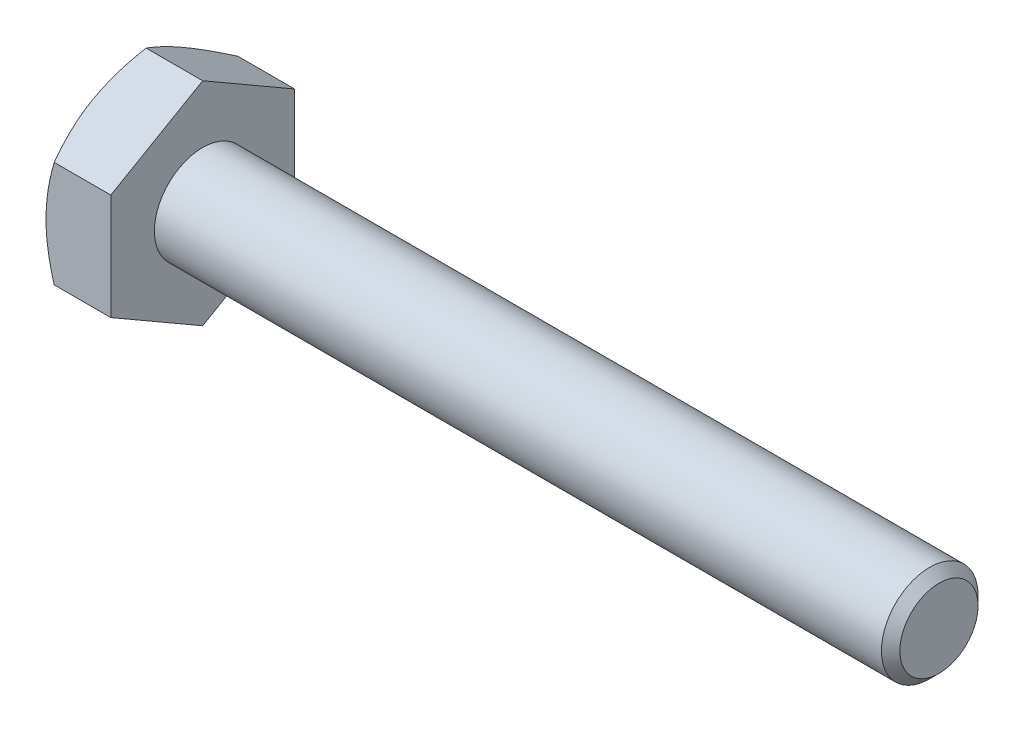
ISO-10303-21;
HEADER;
FILE_DESCRIPTION(('STEP AP214'),'2;1');
FILE_NAME('part.step','',(''),(''),'','','');
FILE_SCHEMA(('AUTOMOTIVE_DESIGN { 1 0 10303 214 1 1 1 1 }'));
ENDSEC;
DATA;
#1=APPLICATION_CONTEXT('core data for automotive mechanical design processes');
#2=APPLICATION_PROTOCOL_DEFINITION('international standard','automotive_design',2000,#1);
#3=PRODUCT_CONTEXT('',#1,'mechanical');
#4=PRODUCT('Part','Part','',(#3));
#5=PRODUCT_RELATED_PRODUCT_CATEGORY('part','',(#4));
#6=PRODUCT_DEFINITION_FORMATION('','',#4);
#7=PRODUCT_DEFINITION_CONTEXT('part definition',#1,'design');
#8=PRODUCT_DEFINITION('design','',#6,#7);
#9=PRODUCT_DEFINITION_SHAPE('','',#8);
#10=(LENGTH_UNIT() NAMED_UNIT(*) SI_UNIT(.MILLI.,.METRE.));
#11=(NAMED_UNIT(*) PLANE_ANGLE_UNIT() SI_UNIT($,.RADIAN.));
#12=(NAMED_UNIT(*) SI_UNIT($,.STERADIAN.) SOLID_ANGLE_UNIT());
#13=UNCERTAINTY_MEASURE_WITH_UNIT(LENGTH_MEASURE(1.E-05),#10,'distance_accuracy_value','');
#14=(GEOMETRIC_REPRESENTATION_CONTEXT(3) GLOBAL_UNCERTAINTY_ASSIGNED_CONTEXT((#13)) GLOBAL_UNIT_ASSIGNED_CONTEXT((#10,
#11,#12)) REPRESENTATION_CONTEXT('',''));
#15=CARTESIAN_POINT('',(0.,0.,0.));
#16=DIRECTION('',(0.,0.,1.));
#17=DIRECTION('',(1.,0.,0.));
#18=AXIS2_PLACEMENT_3D('',#15,#16,#17);
#19=CARTESIAN_POINT('',(-2.5136,0.,0.));
#20=DIRECTION('',(1.,0.,0.));
#21=DIRECTION('',(0.,0.,-1.));
#22=AXIS2_PLACEMENT_3D('',#19,#20,#21);
#23=PLANE('',#22);
#24=CARTESIAN_POINT('',(-2.5136,0.,0.));
#25=DIRECTION('',(1.,0.,0.));
#26=DIRECTION('',(0.,1.,0.));
#27=AXIS2_PLACEMENT_3D('',#24,#25,#26);
#28=CIRCLE('',#27,3.16992);
#29=CARTESIAN_POINT('',(-2.5136,3.16992,0.));
#30=VERTEX_POINT('',#29);
#31=EDGE_CURVE('E19',#30,#30,#28,.F.);
#32=ORIENTED_EDGE('',*,*,#31,.T.);
#33=EDGE_LOOP('',(#32));
#34=FACE_BOUND('',#33,.T.);
#35=ADVANCED_FACE('F16',(#34),#23,.F.);
#36=CARTESIAN_POINT('',(-2.794,0.,0.));
#37=DIRECTION('',(1.,0.,0.));
#38=DIRECTION('',(0.,1.,0.));
#39=AXIS2_PLACEMENT_3D('',#36,#37,#38);
#40=CYLINDRICAL_SURFACE('',#39,3.16992);
#41=CARTESIAN_POINT('',(-2.794,0.,0.));
#42=DIRECTION('',(1.,0.,0.));
#43=DIRECTION('',(0.,1.,0.));
#44=AXIS2_PLACEMENT_3D('',#41,#42,#43);
#45=CIRCLE('',#44,3.16992);
#46=CARTESIAN_POINT('',(-2.794,3.16992,0.));
#47=VERTEX_POINT('',#46);
#48=EDGE_CURVE('E114',#47,#47,#45,.F.);
#49=ORIENTED_EDGE('',*,*,#48,.T.);
#50=EDGE_LOOP('',(#49));
#51=FACE_BOUND('',#50,.T.);
#52=ORIENTED_EDGE('',*,*,#31,.F.);
#53=EDGE_LOOP('',(#52));
#54=FACE_BOUND('',#53,.T.);
#55=ADVANCED_FACE('F347',(#51,#54),#40,.F.);
#56=CARTESIAN_POINT('',(-2.794,0.,0.));
#57=DIRECTION('',(1.,0.,0.));
#58=DIRECTION('',(0.,0.,-1.));
#59=AXIS2_PLACEMENT_3D('',#56,#57,#58);
#60=PLANE('',#59);
#61=ORIENTED_EDGE('',*,*,#48,.F.);
#62=EDGE_LOOP('',(#61));
#63=FACE_BOUND('',#62,.T.);
#64=CARTESIAN_POINT('',(-2.79400000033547,0.,0.));
#65=DIRECTION('',(1.,0.,0.));
#66=DIRECTION('',(0.,0.,-1.));
#67=AXIS2_PLACEMENT_3D('',#64,#65,#66);
#68=CIRCLE('',#67,3.96240000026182);
#69=CARTESIAN_POINT('',(-2.79400000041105,3.43153906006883,-1.98120000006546));
#70=VERTEX_POINT('',#69);
#71=CARTESIAN_POINT('',(-2.79400000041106,3.43153906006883,1.98120000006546));
#72=VERTEX_POINT('',#71);
#73=EDGE_CURVE('E332',#70,#72,#68,.T.);
#74=ORIENTED_EDGE('',*,*,#73,.F.);
#75=CARTESIAN_POINT('',(-2.79400000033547,0.,0.));
#76=DIRECTION('',(1.,0.,0.));
#77=DIRECTION('',(0.,0.,-1.));
#78=AXIS2_PLACEMENT_3D('',#75,#76,#77);
#79=CIRCLE('',#78,3.96240000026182);
#80=CARTESIAN_POINT('',(-2.79400000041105,0.,-3.96240000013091));
#81=VERTEX_POINT('',#80);
#82=EDGE_CURVE('E333',#81,#70,#79,.T.);
#83=ORIENTED_EDGE('',*,*,#82,.F.);
#84=CARTESIAN_POINT('',(-2.79400000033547,0.,0.));
#85=DIRECTION('',(1.,0.,0.));
#86=DIRECTION('',(0.,0.,-1.));
#87=AXIS2_PLACEMENT_3D('',#84,#85,#86);
#88=CIRCLE('',#87,3.96240000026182);
#89=CARTESIAN_POINT('',(-2.79400000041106,-3.43153906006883,-1.98120000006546));
#90=VERTEX_POINT('',#89);
#91=EDGE_CURVE('E335',#90,#81,#88,.T.);
#92=ORIENTED_EDGE('',*,*,#91,.F.);
#93=CARTESIAN_POINT('',(-2.79400000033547,0.,0.));
#94=DIRECTION('',(1.,0.,0.));
#95=DIRECTION('',(0.,0.,-1.));
#96=AXIS2_PLACEMENT_3D('',#93,#94,#95);
#97=CIRCLE('',#96,3.96240000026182);
#98=CARTESIAN_POINT('',(-2.79400000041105,-3.43153906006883,1.98120000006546));
#99=VERTEX_POINT('',#98);
#100=EDGE_CURVE('E92',#99,#90,#97,.T.);
#101=ORIENTED_EDGE('',*,*,#100,.F.);
#102=CARTESIAN_POINT('',(-2.79400000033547,0.,0.));
#103=DIRECTION('',(1.,0.,0.));
#104=DIRECTION('',(0.,0.,-1.));
#105=AXIS2_PLACEMENT_3D('',#102,#103,#104);
#106=CIRCLE('',#105,3.96240000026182);
#107=CARTESIAN_POINT('',(-2.79400000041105,0.,3.96240000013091));
#108=VERTEX_POINT('',#107);
#109=EDGE_CURVE('E88',#108,#99,#106,.T.);
#110=ORIENTED_EDGE('',*,*,#109,.F.);
#111=CARTESIAN_POINT('',(-2.79400000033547,0.,0.));
#112=DIRECTION('',(1.,0.,0.));
#113=DIRECTION('',(0.,0.,-1.));
#114=AXIS2_PLACEMENT_3D('',#111,#112,#113);
#115=CIRCLE('',#114,3.96240000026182);
#116=EDGE_CURVE('E85',#72,#108,#115,.T.);
#117=ORIENTED_EDGE('',*,*,#116,.F.);
#118=EDGE_LOOP('',(#74,#83,#92,#101,#110,#117));
#119=FACE_BOUND('',#118,.T.);
#120=ADVANCED_FACE('F90',(#63,#119),#60,.F.);
#121=CARTESIAN_POINT('',(-2.43796926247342,0.,0.));
#122=DIRECTION('',(1.,0.,0.));
#123=DIRECTION('',(0.,0.,-1.));
#124=AXIS2_PLACEMENT_3D('',#121,#122,#123);
#125=CONICAL_SURFACE('',#124,4.57906332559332,1.0471975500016);
#126=ORIENTED_EDGE('',*,*,#116,.T.);
#127=CARTESIAN_POINT('',(-2.44009270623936,2.28769270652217,3.96240000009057));
#128=CARTESIAN_POINT('',(-2.49386247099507,2.10147549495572,3.96240000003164));
#129=CARTESIAN_POINT('',(-2.54312496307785,1.91376698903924,3.96240000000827));
#130=CARTESIAN_POINT('',(-2.62999848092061,1.53669534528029,3.96239999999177));
#131=CARTESIAN_POINT('',(-2.6676671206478,1.3473453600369,3.96239999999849));
#132=CARTESIAN_POINT('',(-2.71391781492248,1.06153337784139,3.96240000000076));
#133=CARTESIAN_POINT('',(-2.72763161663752,0.965901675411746,3.9624000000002));
#134=CARTESIAN_POINT('',(-2.75137049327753,0.774180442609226,3.9623999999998));
#135=CARTESIAN_POINT('',(-2.76139566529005,0.678090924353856,3.96239999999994));
#136=CARTESIAN_POINT('',(-2.77758114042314,0.485098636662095,3.96240000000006));
#137=CARTESIAN_POINT('',(-2.78372178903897,0.388194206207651,3.96240000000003));
#138=CARTESIAN_POINT('',(-2.79193971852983,0.194194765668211,3.96239999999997));
#139=CARTESIAN_POINT('',(-2.79401619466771,0.0970997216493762,3.96239999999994));
#140=CARTESIAN_POINT('',(-2.79400000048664,7.71287001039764E-12,3.9624));
#141=B_SPLINE_CURVE_WITH_KNOTS('',3,(#127,#128,#129,#130,#131,#132,#133,#134,#135,#136,#137,
#138,#139,#140),.UNSPECIFIED.,.F.,.F.,(4,2,2,2,2,2,4),(0.,0.581709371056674,1.1604795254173,
1.45024433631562,1.74000151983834,2.03121330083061,2.32248273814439),.UNSPECIFIED.);
#142=CARTESIAN_POINT('',(-2.44009270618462,2.28769270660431,3.96239999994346));
#143=VERTEX_POINT('',#142);
#144=EDGE_CURVE('E111',#143,#108,#141,.T.);
#145=ORIENTED_EDGE('',*,*,#144,.F.);
#146=CARTESIAN_POINT('',(-2.79400000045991,3.43153905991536,1.98119999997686));
#147=CARTESIAN_POINT('',(-2.79401619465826,3.38298919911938,2.06529082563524));
#148=CARTESIAN_POINT('',(-2.79193971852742,3.33444167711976,2.14937760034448));
#149=CARTESIAN_POINT('',(-2.78372178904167,3.23744195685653,2.31738604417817));
#150=CARTESIAN_POINT('',(-2.77758114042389,3.188989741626,2.40130774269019));
#151=CARTESIAN_POINT('',(-2.76139566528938,3.09249359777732,2.56844396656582));
#152=CARTESIAN_POINT('',(-2.75137049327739,3.04444883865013,2.65165993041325));
#153=CARTESIAN_POINT('',(-2.72763161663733,2.94858822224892,2.81769538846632));
#154=CARTESIAN_POINT('',(-2.71391781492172,2.90077237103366,2.90051487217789));
#155=CARTESIAN_POINT('',(-2.66766712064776,2.75786637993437,3.14803530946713));
#156=CARTESIAN_POINT('',(-2.62999848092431,2.66319138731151,3.31201720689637));
#157=CARTESIAN_POINT('',(-2.54312496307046,2.47465556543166,3.63857082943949));
#158=CARTESIAN_POINT('',(-2.4938624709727,2.38080131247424,3.80113116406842));
#159=CARTESIAN_POINT('',(-2.44009270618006,2.28769270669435,3.9623999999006));
#160=B_SPLINE_CURVE_WITH_KNOTS('',3,(#146,#147,#148,#149,#150,#151,#152,#153,#154,#155,#156,
#157,#158,#159),.UNSPECIFIED.,.F.,.F.,(4,2,2,2,2,2,4),(0.,0.29126943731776,0.582481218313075,
0.872238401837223,1.1620032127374,1.74077336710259,2.32248273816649),.UNSPECIFIED.);
#161=EDGE_CURVE('E105',#72,#143,#160,.T.);
#162=ORIENTED_EDGE('',*,*,#161,.F.);
#163=EDGE_LOOP('',(#126,#145,#162));
#164=FACE_BOUND('',#163,.T.);
#165=ADVANCED_FACE('F110',(#164),#125,.T.);
#166=CARTESIAN_POINT('',(-2.43796926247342,0.,0.));
#167=DIRECTION('',(1.,0.,0.));
#168=DIRECTION('',(0.,0.,-1.));
#169=AXIS2_PLACEMENT_3D('',#166,#167,#168);
#170=CONICAL_SURFACE('',#169,4.57906332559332,1.0471975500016);
#171=CARTESIAN_POINT('',(-2.79400000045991,0.,3.96239999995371));
#172=CARTESIAN_POINT('',(-2.79401619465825,-0.0970997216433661,3.96239999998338));
#173=CARTESIAN_POINT('',(-2.79193971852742,-0.194194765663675,3.96239999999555));
#174=CARTESIAN_POINT('',(-2.78372178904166,-0.388194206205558,3.96240000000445));
#175=CARTESIAN_POINT('',(-2.77758114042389,-0.485098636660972,3.96240000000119));
#176=CARTESIAN_POINT('',(-2.76139566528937,-0.678090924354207,3.96239999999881));
#177=CARTESIAN_POINT('',(-2.75137049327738,-0.774180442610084,3.96239999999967));
#178=CARTESIAN_POINT('',(-2.72763161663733,-0.965901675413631,3.96240000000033));
#179=CARTESIAN_POINT('',(-2.71391781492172,-1.0615333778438,3.96240000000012));
#180=CARTESIAN_POINT('',(-2.66766712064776,-1.34734536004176,3.96239999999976));
#181=CARTESIAN_POINT('',(-2.6299984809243,-1.53669534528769,3.96239999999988));
#182=CARTESIAN_POINT('',(-2.54312496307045,-1.91376698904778,3.96240000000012));
#183=CARTESIAN_POINT('',(-2.4938624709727,-2.10147549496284,3.96240000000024));
#184=CARTESIAN_POINT('',(-2.44009270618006,-2.2876927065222,3.9624));
#185=B_SPLINE_CURVE_WITH_KNOTS('',3,(#171,#172,#173,#174,#175,#176,#177,#178,#179,#180,#181,
#182,#183,#184),.UNSPECIFIED.,.F.,.F.,(4,2,2,2,2,2,4),(0.,0.291269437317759,0.582481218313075,
0.872238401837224,1.1620032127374,1.74077336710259,2.3224827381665),.UNSPECIFIED.);
#186=CARTESIAN_POINT('',(-2.44009270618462,-2.28769270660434,3.96239999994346));
#187=VERTEX_POINT('',#186);
#188=EDGE_CURVE('E98',#108,#187,#185,.T.);
#189=ORIENTED_EDGE('',*,*,#188,.F.);
#190=ORIENTED_EDGE('',*,*,#109,.T.);
#191=CARTESIAN_POINT('',(-2.44009270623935,-2.28769270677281,3.96239999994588));
#192=CARTESIAN_POINT('',(-2.49386247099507,-2.380801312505,3.80113116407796));
#193=CARTESIAN_POINT('',(-2.54312496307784,-2.474655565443,3.63857082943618));
#194=CARTESIAN_POINT('',(-2.6299984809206,-2.66319138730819,3.31201720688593));
#195=CARTESIAN_POINT('',(-2.6676671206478,-2.75786637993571,3.14803530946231));
#196=CARTESIAN_POINT('',(-2.71391781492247,-2.90077237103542,2.90051487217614));
#197=CARTESIAN_POINT('',(-2.72763161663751,-2.94858822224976,2.81769538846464));
#198=CARTESIAN_POINT('',(-2.75137049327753,-3.04444883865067,2.65165993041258));
#199=CARTESIAN_POINT('',(-2.76139566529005,-3.09249359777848,2.56844396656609));
#200=CARTESIAN_POINT('',(-2.77758114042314,-3.18898974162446,2.40130774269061));
#201=CARTESIAN_POINT('',(-2.78372178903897,-3.23744195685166,2.31738604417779));
#202=CARTESIAN_POINT('',(-2.79193971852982,-3.33444167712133,2.14937760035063));
#203=CARTESIAN_POINT('',(-2.79401619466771,-3.38298919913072,2.06529082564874));
#204=CARTESIAN_POINT('',(-2.79400000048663,-3.4315390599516,1.98120000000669));
#205=B_SPLINE_CURVE_WITH_KNOTS('',3,(#191,#192,#193,#194,#195,#196,#197,#198,#199,#200,#201,
#202,#203,#204),.UNSPECIFIED.,.F.,.F.,(4,2,2,2,2,2,4),(0.,0.581709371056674,1.1604795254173,
1.45024433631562,1.74000151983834,2.03121330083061,2.32248273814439),.UNSPECIFIED.);
#206=EDGE_CURVE('E100',#187,#99,#205,.T.);
#207=ORIENTED_EDGE('',*,*,#206,.F.);
#208=EDGE_LOOP('',(#189,#190,#207));
#209=FACE_BOUND('',#208,.T.);
#210=ADVANCED_FACE('F99',(#209),#170,.T.);
#211=CARTESIAN_POINT('',(-2.43796926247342,0.,0.));
#212=DIRECTION('',(1.,0.,0.));
#213=DIRECTION('',(0.,0.,-1.));
#214=AXIS2_PLACEMENT_3D('',#211,#212,#213);
#215=CONICAL_SURFACE('',#214,4.57906332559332,1.0471975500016);
#216=CARTESIAN_POINT('',(-2.7940000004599,-3.43153905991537,1.98119999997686));
#217=CARTESIAN_POINT('',(-2.79401619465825,-3.48008892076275,1.89710917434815));
#218=CARTESIAN_POINT('',(-2.79193971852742,-3.52863644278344,1.81302239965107));
#219=CARTESIAN_POINT('',(-2.78372178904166,-3.6256361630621,1.64501395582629));
#220=CARTESIAN_POINT('',(-2.77758114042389,-3.67408837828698,1.56109225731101));
#221=CARTESIAN_POINT('',(-2.76139566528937,-3.77058452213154,1.393956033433));
#222=CARTESIAN_POINT('',(-2.75137049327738,-3.81862928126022,1.31074006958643));
#223=CARTESIAN_POINT('',(-2.72763161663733,-3.91448989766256,1.14470461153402));
#224=CARTESIAN_POINT('',(-2.71391781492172,-3.96230574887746,1.06188512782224));
#225=CARTESIAN_POINT('',(-2.66766712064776,-4.10521173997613,0.81436469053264));
#226=CARTESIAN_POINT('',(-2.6299984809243,-4.1998867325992,0.650382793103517));
#227=CARTESIAN_POINT('',(-2.54312496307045,-4.38842255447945,0.323829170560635));
#228=CARTESIAN_POINT('',(-2.4938624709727,-4.48227680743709,0.161268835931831));
#229=CARTESIAN_POINT('',(-2.44009270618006,-4.57538541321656,9.94113552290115E-11));
#230=B_SPLINE_CURVE_WITH_KNOTS('',3,(#216,#217,#218,#219,#220,#221,#222,#223,#224,#225,#226,
#227,#228,#229),.UNSPECIFIED.,.F.,.F.,(4,2,2,2,2,2,4),(0.,0.291269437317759,0.582481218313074,
0.872238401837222,1.1620032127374,1.74077336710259,2.32248273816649),.UNSPECIFIED.);
#231=CARTESIAN_POINT('',(-2.44009270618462,-4.57538541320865,0.));
#232=VERTEX_POINT('',#231);
#233=EDGE_CURVE('E118',#99,#232,#230,.T.);
#234=ORIENTED_EDGE('',*,*,#233,.F.);
#235=ORIENTED_EDGE('',*,*,#100,.T.);
#236=CARTESIAN_POINT('',(-2.44009270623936,-4.57538541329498,-1.44688809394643E-10));
#237=CARTESIAN_POINT('',(-2.49386247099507,-4.48227680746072,-0.161268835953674));
#238=CARTESIAN_POINT('',(-2.54312496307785,-4.38842255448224,-0.323829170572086));
#239=CARTESIAN_POINT('',(-2.62999848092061,-4.19988673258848,-0.650382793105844));
#240=CARTESIAN_POINT('',(-2.6676671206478,-4.1052117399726,-0.814364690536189));
#241=CARTESIAN_POINT('',(-2.71391781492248,-3.96230574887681,-1.06188512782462));
#242=CARTESIAN_POINT('',(-2.72763161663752,-3.91448989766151,-1.14470461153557));
#243=CARTESIAN_POINT('',(-2.75137049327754,-3.81862928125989,-1.31074006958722));
#244=CARTESIAN_POINT('',(-2.76139566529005,-3.77058452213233,-1.39395603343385));
#245=CARTESIAN_POINT('',(-2.77758114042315,-3.67408837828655,-1.56109225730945));
#246=CARTESIAN_POINT('',(-2.78372178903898,-3.62563616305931,-1.64501395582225));
#247=CARTESIAN_POINT('',(-2.79193971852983,-3.52863644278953,-1.81302239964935));
#248=CARTESIAN_POINT('',(-2.79401619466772,-3.48008892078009,-1.89710917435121));
#249=CARTESIAN_POINT('',(-2.79400000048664,-3.43153905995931,-1.98119999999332));
#250=B_SPLINE_CURVE_WITH_KNOTS('',3,(#236,#237,#238,#239,#240,#241,#242,#243,#244,#245,#246,
#247,#248,#249),.UNSPECIFIED.,.F.,.F.,(4,2,2,2,2,2,4),(0.,0.581709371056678,1.16047952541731,
1.45024433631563,1.74000151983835,2.03121330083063,2.32248273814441),.UNSPECIFIED.);
#251=EDGE_CURVE('E214',#232,#90,#250,.T.);
#252=ORIENTED_EDGE('',*,*,#251,.F.);
#253=EDGE_LOOP('',(#234,#235,#252));
#254=FACE_BOUND('',#253,.T.);
#255=ADVANCED_FACE('F222',(#254),#215,.T.);
#256=CARTESIAN_POINT('',(-2.43796926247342,0.,0.));
#257=DIRECTION('',(1.,0.,0.));
#258=DIRECTION('',(0.,0.,-1.));
#259=AXIS2_PLACEMENT_3D('',#256,#257,#258);
#260=CONICAL_SURFACE('',#259,4.57906332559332,1.0471975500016);
#261=CARTESIAN_POINT('',(-2.79400000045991,-3.43153905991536,-1.98119999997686));
#262=CARTESIAN_POINT('',(-2.79401619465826,-3.38298919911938,-2.06529082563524));
#263=CARTESIAN_POINT('',(-2.79193971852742,-3.33444167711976,-2.14937760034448));
#264=CARTESIAN_POINT('',(-2.78372178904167,-3.23744195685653,-2.31738604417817));
#265=CARTESIAN_POINT('',(-2.77758114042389,-3.188989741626,-2.40130774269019));
#266=CARTESIAN_POINT('',(-2.76139566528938,-3.09249359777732,-2.56844396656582));
#267=CARTESIAN_POINT('',(-2.75137049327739,-3.04444883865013,-2.65165993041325));
#268=CARTESIAN_POINT('',(-2.72763161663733,-2.94858822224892,-2.81769538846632));
#269=CARTESIAN_POINT('',(-2.71391781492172,-2.90077237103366,-2.90051487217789));
#270=CARTESIAN_POINT('',(-2.66766712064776,-2.75786637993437,-3.14803530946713));
#271=CARTESIAN_POINT('',(-2.62999848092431,-2.66319138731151,-3.31201720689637));
#272=CARTESIAN_POINT('',(-2.54312496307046,-2.47465556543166,-3.63857082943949));
#273=CARTESIAN_POINT('',(-2.4938624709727,-2.38080131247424,-3.80113116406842));
#274=CARTESIAN_POINT('',(-2.44009270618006,-2.28769270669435,-3.9623999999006));
#275=B_SPLINE_CURVE_WITH_KNOTS('',3,(#261,#262,#263,#264,#265,#266,#267,#268,#269,#270,#271,
#272,#273,#274),.UNSPECIFIED.,.F.,.F.,(4,2,2,2,2,2,4),(0.,0.291269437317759,0.582481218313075,
0.872238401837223,1.1620032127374,1.74077336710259,2.32248273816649),.UNSPECIFIED.);
#276=CARTESIAN_POINT('',(-2.44009270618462,-2.28769270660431,-3.96239999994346));
#277=VERTEX_POINT('',#276);
#278=EDGE_CURVE('E226',#90,#277,#275,.T.);
#279=ORIENTED_EDGE('',*,*,#278,.F.);
#280=ORIENTED_EDGE('',*,*,#91,.T.);
#281=CARTESIAN_POINT('',(-2.44009270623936,-2.28769270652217,-3.96240000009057));
#282=CARTESIAN_POINT('',(-2.49386247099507,-2.10147549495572,-3.96240000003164));
#283=CARTESIAN_POINT('',(-2.54312496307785,-1.91376698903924,-3.96240000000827));
#284=CARTESIAN_POINT('',(-2.62999848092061,-1.53669534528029,-3.96239999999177));
#285=CARTESIAN_POINT('',(-2.6676671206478,-1.3473453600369,-3.96239999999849));
#286=CARTESIAN_POINT('',(-2.71391781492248,-1.06153337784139,-3.96240000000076));
#287=CARTESIAN_POINT('',(-2.72763161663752,-0.965901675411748,-3.9624000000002));
#288=CARTESIAN_POINT('',(-2.75137049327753,-0.774180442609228,-3.9623999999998));
#289=CARTESIAN_POINT('',(-2.76139566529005,-0.678090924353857,-3.96239999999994));
#290=CARTESIAN_POINT('',(-2.77758114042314,-0.485098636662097,-3.96240000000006));
#291=CARTESIAN_POINT('',(-2.78372178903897,-0.388194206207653,-3.96240000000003));
#292=CARTESIAN_POINT('',(-2.79193971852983,-0.194194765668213,-3.96239999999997));
#293=CARTESIAN_POINT('',(-2.79401619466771,-0.0970997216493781,-3.96239999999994));
#294=CARTESIAN_POINT('',(-2.79400000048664,-7.71468599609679E-12,-3.9624));
#295=B_SPLINE_CURVE_WITH_KNOTS('',3,(#281,#282,#283,#284,#285,#286,#287,#288,#289,#290,#291,
#292,#293,#294),.UNSPECIFIED.,.F.,.F.,(4,2,2,2,2,2,4),(0.,0.581709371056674,1.1604795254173,
1.45024433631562,1.74000151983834,2.03121330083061,2.32248273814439),.UNSPECIFIED.);
#296=EDGE_CURVE('E208',#277,#81,#295,.T.);
#297=ORIENTED_EDGE('',*,*,#296,.F.);
#298=EDGE_LOOP('',(#279,#280,#297));
#299=FACE_BOUND('',#298,.T.);
#300=ADVANCED_FACE('F219',(#299),#260,.T.);
#301=CARTESIAN_POINT('',(-2.43796926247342,0.,0.));
#302=DIRECTION('',(1.,0.,0.));
#303=DIRECTION('',(0.,0.,-1.));
#304=AXIS2_PLACEMENT_3D('',#301,#302,#303);
#305=CONICAL_SURFACE('',#304,4.57906332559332,1.0471975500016);
#306=ORIENTED_EDGE('',*,*,#82,.T.);
#307=CARTESIAN_POINT('',(-2.44009270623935,2.28769270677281,-3.96239999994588));
#308=CARTESIAN_POINT('',(-2.49386247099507,2.380801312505,-3.80113116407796));
#309=CARTESIAN_POINT('',(-2.54312496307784,2.474655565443,-3.63857082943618));
#310=CARTESIAN_POINT('',(-2.6299984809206,2.66319138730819,-3.31201720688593));
#311=CARTESIAN_POINT('',(-2.6676671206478,2.75786637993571,-3.14803530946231));
#312=CARTESIAN_POINT('',(-2.71391781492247,2.90077237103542,-2.90051487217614));
#313=CARTESIAN_POINT('',(-2.72763161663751,2.94858822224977,-2.81769538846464));
#314=CARTESIAN_POINT('',(-2.75137049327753,3.04444883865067,-2.65165993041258));
#315=CARTESIAN_POINT('',(-2.76139566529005,3.09249359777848,-2.56844396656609));
#316=CARTESIAN_POINT('',(-2.77758114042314,3.18898974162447,-2.40130774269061));
#317=CARTESIAN_POINT('',(-2.78372178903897,3.23744195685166,-2.31738604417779));
#318=CARTESIAN_POINT('',(-2.79193971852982,3.33444167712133,-2.14937760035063));
#319=CARTESIAN_POINT('',(-2.79401619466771,3.38298919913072,-2.06529082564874));
#320=CARTESIAN_POINT('',(-2.79400000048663,3.43153905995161,-1.98120000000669));
#321=B_SPLINE_CURVE_WITH_KNOTS('',3,(#307,#308,#309,#310,#311,#312,#313,#314,#315,#316,#317,
#318,#319,#320),.UNSPECIFIED.,.F.,.F.,(4,2,2,2,2,2,4),(0.,0.581709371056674,1.1604795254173,
1.45024433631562,1.74000151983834,2.03121330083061,2.32248273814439),.UNSPECIFIED.);
#322=CARTESIAN_POINT('',(-2.44009270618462,2.28769270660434,-3.96239999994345));
#323=VERTEX_POINT('',#322);
#324=EDGE_CURVE('E180',#323,#70,#321,.T.);
#325=ORIENTED_EDGE('',*,*,#324,.F.);
#326=CARTESIAN_POINT('',(-2.79400000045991,0.,-3.96239999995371));
#327=CARTESIAN_POINT('',(-2.79401619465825,0.0970997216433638,-3.96239999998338));
#328=CARTESIAN_POINT('',(-2.79193971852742,0.194194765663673,-3.96239999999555));
#329=CARTESIAN_POINT('',(-2.78372178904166,0.388194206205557,-3.96240000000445));
#330=CARTESIAN_POINT('',(-2.77758114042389,0.48509863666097,-3.96240000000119));
#331=CARTESIAN_POINT('',(-2.76139566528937,0.678090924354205,-3.96239999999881));
#332=CARTESIAN_POINT('',(-2.75137049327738,0.774180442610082,-3.96239999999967));
#333=CARTESIAN_POINT('',(-2.72763161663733,0.96590167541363,-3.96240000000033));
#334=CARTESIAN_POINT('',(-2.71391781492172,1.0615333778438,-3.96240000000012));
#335=CARTESIAN_POINT('',(-2.66766712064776,1.34734536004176,-3.96239999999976));
#336=CARTESIAN_POINT('',(-2.6299984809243,1.53669534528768,-3.96239999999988));
#337=CARTESIAN_POINT('',(-2.54312496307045,1.91376698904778,-3.96240000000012));
#338=CARTESIAN_POINT('',(-2.4938624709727,2.10147549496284,-3.96240000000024));
#339=CARTESIAN_POINT('',(-2.44009270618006,2.2876927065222,-3.9624));
#340=B_SPLINE_CURVE_WITH_KNOTS('',3,(#326,#327,#328,#329,#330,#331,#332,#333,#334,#335,#336,
#337,#338,#339),.UNSPECIFIED.,.F.,.F.,(4,2,2,2,2,2,4),(0.,0.29126943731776,0.582481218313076,
0.872238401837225,1.16200321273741,1.74077336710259,2.3224827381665),.UNSPECIFIED.);
#341=EDGE_CURVE('E203',#81,#323,#340,.T.);
#342=ORIENTED_EDGE('',*,*,#341,.F.);
#343=EDGE_LOOP('',(#306,#325,#342));
#344=FACE_BOUND('',#343,.T.);
#345=ADVANCED_FACE('F165',(#344),#305,.T.);
#346=CARTESIAN_POINT('',(-2.43796926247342,0.,0.));
#347=DIRECTION('',(1.,0.,0.));
#348=DIRECTION('',(0.,0.,-1.));
#349=AXIS2_PLACEMENT_3D('',#346,#347,#348);
#350=CONICAL_SURFACE('',#349,4.57906332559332,1.0471975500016);
#351=ORIENTED_EDGE('',*,*,#73,.T.);
#352=CARTESIAN_POINT('',(-2.44009270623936,4.57538541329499,1.44686354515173E-10));
#353=CARTESIAN_POINT('',(-2.49386247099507,4.48227680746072,0.161268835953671));
#354=CARTESIAN_POINT('',(-2.54312496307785,4.38842255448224,0.323829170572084));
#355=CARTESIAN_POINT('',(-2.62999848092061,4.19988673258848,0.650382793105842));
#356=CARTESIAN_POINT('',(-2.6676671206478,4.10521173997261,0.814364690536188));
#357=CARTESIAN_POINT('',(-2.71391781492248,3.96230574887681,1.06188512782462));
#358=CARTESIAN_POINT('',(-2.72763161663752,3.91448989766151,1.14470461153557));
#359=CARTESIAN_POINT('',(-2.75137049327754,3.81862928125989,1.31074006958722));
#360=CARTESIAN_POINT('',(-2.76139566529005,3.77058452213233,1.39395603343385));
#361=CARTESIAN_POINT('',(-2.77758114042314,3.67408837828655,1.56109225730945));
#362=CARTESIAN_POINT('',(-2.78372178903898,3.62563616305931,1.64501395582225));
#363=CARTESIAN_POINT('',(-2.79193971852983,3.52863644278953,1.81302239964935));
#364=CARTESIAN_POINT('',(-2.79401619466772,3.48008892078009,1.89710917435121));
#365=CARTESIAN_POINT('',(-2.79400000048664,3.43153905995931,1.98119999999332));
#366=B_SPLINE_CURVE_WITH_KNOTS('',3,(#352,#353,#354,#355,#356,#357,#358,#359,#360,#361,#362,
#363,#364,#365),.UNSPECIFIED.,.F.,.F.,(4,2,2,2,2,2,4),(0.,0.581709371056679,1.16047952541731,
1.45024433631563,1.74000151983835,2.03121330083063,2.32248273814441),.UNSPECIFIED.);
#367=CARTESIAN_POINT('',(-2.44009270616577,4.5753854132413,5.65399492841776E-11));
#368=VERTEX_POINT('',#367);
#369=EDGE_CURVE('E150',#368,#72,#366,.T.);
#370=ORIENTED_EDGE('',*,*,#369,.F.);
#371=CARTESIAN_POINT('',(-2.7940000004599,3.43153905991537,-1.98119999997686));
#372=CARTESIAN_POINT('',(-2.79401619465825,3.48008892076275,-1.89710917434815));
#373=CARTESIAN_POINT('',(-2.79193971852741,3.52863644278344,-1.81302239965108));
#374=CARTESIAN_POINT('',(-2.78372178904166,3.6256361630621,-1.64501395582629));
#375=CARTESIAN_POINT('',(-2.77758114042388,3.67408837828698,-1.56109225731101));
#376=CARTESIAN_POINT('',(-2.76139566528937,3.77058452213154,-1.393956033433));
#377=CARTESIAN_POINT('',(-2.75137049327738,3.81862928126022,-1.31074006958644));
#378=CARTESIAN_POINT('',(-2.72763161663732,3.91448989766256,-1.14470461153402));
#379=CARTESIAN_POINT('',(-2.71391781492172,3.96230574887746,-1.06188512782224));
#380=CARTESIAN_POINT('',(-2.66766712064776,4.10521173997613,-0.814364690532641));
#381=CARTESIAN_POINT('',(-2.6299984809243,4.1998867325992,-0.650382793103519));
#382=CARTESIAN_POINT('',(-2.54312496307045,4.38842255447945,-0.323829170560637));
#383=CARTESIAN_POINT('',(-2.4938624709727,4.48227680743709,-0.161268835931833));
#384=CARTESIAN_POINT('',(-2.44009270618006,4.57538541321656,-9.9413722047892E-11));
#385=B_SPLINE_CURVE_WITH_KNOTS('',3,(#371,#372,#373,#374,#375,#376,#377,#378,#379,#380,#381,
#382,#383,#384),.UNSPECIFIED.,.F.,.F.,(4,2,2,2,2,2,4),(0.,0.291269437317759,0.582481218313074,
0.872238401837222,1.1620032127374,1.74077336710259,2.32248273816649),.UNSPECIFIED.);
#386=EDGE_CURVE('E171',#70,#368,#385,.T.);
#387=ORIENTED_EDGE('',*,*,#386,.F.);
#388=EDGE_LOOP('',(#351,#370,#387));
#389=FACE_BOUND('',#388,.T.);
#390=ADVANCED_FACE('F159',(#389),#350,.T.);
#391=CARTESIAN_POINT('',(0.,4.57538541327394,0.));
#392=DIRECTION('',(0.,0.866025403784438,0.500000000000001));
#393=DIRECTION('',(0.,-0.500000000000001,0.866025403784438));
#394=AXIS2_PLACEMENT_3D('',#391,#392,#393);
#395=PLANE('',#394);
#396=DIRECTION('',(0.,-0.500000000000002,0.866025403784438));
#397=VECTOR('',#396,1.);
#398=CARTESIAN_POINT('',(0.,4.57538541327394,0.));
#399=LINE('',#398,#397);
#400=CARTESIAN_POINT('',(0.,4.57538541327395,0.));
#401=VERTEX_POINT('',#400);
#402=CARTESIAN_POINT('',(0.,2.28769270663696,3.9624));
#403=VERTEX_POINT('',#402);
#404=EDGE_CURVE('E286',#401,#403,#399,.T.);
#405=ORIENTED_EDGE('',*,*,#404,.F.);
#406=DIRECTION('',(1.,0.,0.));
#407=VECTOR('',#406,1.);
#408=CARTESIAN_POINT('',(0.,4.57538541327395,0.));
#409=LINE('',#408,#407);
#410=EDGE_CURVE('E179',#368,#401,#409,.T.);
#411=ORIENTED_EDGE('',*,*,#410,.F.);
#412=ORIENTED_EDGE('',*,*,#369,.T.);
#413=ORIENTED_EDGE('',*,*,#161,.T.);
#414=DIRECTION('',(1.,0.,0.));
#415=VECTOR('',#414,1.);
#416=CARTESIAN_POINT('',(0.,2.28769270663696,3.9624));
#417=LINE('',#416,#415);
#418=EDGE_CURVE('E104',#403,#143,#417,.F.);
#419=ORIENTED_EDGE('',*,*,#418,.F.);
#420=EDGE_LOOP('',(#405,#411,#412,#413,#419));
#421=FACE_BOUND('',#420,.T.);
#422=ADVANCED_FACE('F156',(#421),#395,.T.);
#423=CARTESIAN_POINT('',(0.,2.28769270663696,3.9624));
#424=DIRECTION('',(0.,0.,1.));
#425=DIRECTION('',(1.,0.,0.));
#426=AXIS2_PLACEMENT_3D('',#423,#424,#425);
#427=PLANE('',#426);
#428=ORIENTED_EDGE('',*,*,#418,.T.);
#429=ORIENTED_EDGE('',*,*,#144,.T.);
#430=ORIENTED_EDGE('',*,*,#188,.T.);
#431=DIRECTION('',(1.,0.,0.));
#432=VECTOR('',#431,1.);
#433=CARTESIAN_POINT('',(0.,-2.28769270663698,3.9624));
#434=LINE('',#433,#432);
#435=CARTESIAN_POINT('',(0.,-2.28769270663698,3.9624));
#436=VERTEX_POINT('',#435);
#437=EDGE_CURVE('E120',#436,#187,#434,.F.);
#438=ORIENTED_EDGE('',*,*,#437,.F.);
#439=DIRECTION('',(0.,1.,0.));
#440=VECTOR('',#439,1.);
#441=CARTESIAN_POINT('',(0.,0.,3.9624));
#442=LINE('',#441,#440);
#443=EDGE_CURVE('E288',#403,#436,#442,.F.);
#444=ORIENTED_EDGE('',*,*,#443,.F.);
#445=EDGE_LOOP('',(#428,#429,#430,#438,#444));
#446=FACE_BOUND('',#445,.T.);
#447=ADVANCED_FACE('F116',(#446),#427,.T.);
#448=CARTESIAN_POINT('',(0.,-2.28769270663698,3.9624));
#449=DIRECTION('',(0.,-0.866025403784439,0.499999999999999));
#450=DIRECTION('',(0.,-0.499999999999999,-0.866025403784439));
#451=AXIS2_PLACEMENT_3D('',#448,#449,#450);
#452=PLANE('',#451);
#453=ORIENTED_EDGE('',*,*,#437,.T.);
#454=ORIENTED_EDGE('',*,*,#206,.T.);
#455=ORIENTED_EDGE('',*,*,#233,.T.);
#456=DIRECTION('',(1.,0.,0.));
#457=VECTOR('',#456,1.);
#458=CARTESIAN_POINT('',(0.,-4.57538541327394,0.));
#459=LINE('',#458,#457);
#460=CARTESIAN_POINT('',(0.,-4.57538541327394,0.));
#461=VERTEX_POINT('',#460);
#462=EDGE_CURVE('E231',#461,#232,#459,.F.);
#463=ORIENTED_EDGE('',*,*,#462,.F.);
#464=DIRECTION('',(0.,-0.499999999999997,-0.86602540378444));
#465=VECTOR('',#464,1.);
#466=CARTESIAN_POINT('',(0.,-2.28769270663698,3.9624));
#467=LINE('',#466,#465);
#468=EDGE_CURVE('E279',#436,#461,#467,.T.);
#469=ORIENTED_EDGE('',*,*,#468,.F.);
#470=EDGE_LOOP('',(#453,#454,#455,#463,#469));
#471=FACE_BOUND('',#470,.T.);
#472=ADVANCED_FACE('F235',(#471),#452,.T.);
#473=CARTESIAN_POINT('',(0.,-4.57538541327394,0.));
#474=DIRECTION('',(0.,-0.866025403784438,-0.500000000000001));
#475=DIRECTION('',(0.,0.500000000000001,-0.866025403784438));
#476=AXIS2_PLACEMENT_3D('',#473,#474,#475);
#477=PLANE('',#476);
#478=ORIENTED_EDGE('',*,*,#462,.T.);
#479=ORIENTED_EDGE('',*,*,#251,.T.);
#480=ORIENTED_EDGE('',*,*,#278,.T.);
#481=DIRECTION('',(-1.,0.,0.));
#482=VECTOR('',#481,1.);
#483=CARTESIAN_POINT('',(0.,-2.28769270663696,-3.9624));
#484=LINE('',#483,#482);
#485=CARTESIAN_POINT('',(0.,-2.28769270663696,-3.9624));
#486=VERTEX_POINT('',#485);
#487=EDGE_CURVE('E309',#486,#277,#484,.T.);
#488=ORIENTED_EDGE('',*,*,#487,.F.);
#489=DIRECTION('',(0.,0.500000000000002,-0.866025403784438));
#490=VECTOR('',#489,1.);
#491=CARTESIAN_POINT('',(0.,-4.57538541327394,0.));
#492=LINE('',#491,#490);
#493=EDGE_CURVE('E275',#461,#486,#492,.T.);
#494=ORIENTED_EDGE('',*,*,#493,.F.);
#495=EDGE_LOOP('',(#478,#479,#480,#488,#494));
#496=FACE_BOUND('',#495,.T.);
#497=ADVANCED_FACE('F200',(#496),#477,.T.);
#498=CARTESIAN_POINT('',(0.,-2.28769270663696,-3.9624));
#499=DIRECTION('',(0.,0.,-1.));
#500=DIRECTION('',(-1.,0.,0.));
#501=AXIS2_PLACEMENT_3D('',#498,#499,#500);
#502=PLANE('',#501);
#503=DIRECTION('',(0.,1.,0.));
#504=VECTOR('',#503,1.);
#505=CARTESIAN_POINT('',(0.,0.,-3.9624));
#506=LINE('',#505,#504);
#507=CARTESIAN_POINT('',(0.,2.28769270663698,-3.9624));
#508=VERTEX_POINT('',#507);
#509=EDGE_CURVE('E270',#486,#508,#506,.T.);
#510=ORIENTED_EDGE('',*,*,#509,.F.);
#511=ORIENTED_EDGE('',*,*,#487,.T.);
#512=ORIENTED_EDGE('',*,*,#296,.T.);
#513=ORIENTED_EDGE('',*,*,#341,.T.);
#514=DIRECTION('',(1.,0.,0.));
#515=VECTOR('',#514,1.);
#516=CARTESIAN_POINT('',(0.,2.28769270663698,-3.9624));
#517=LINE('',#516,#515);
#518=EDGE_CURVE('E34',#508,#323,#517,.F.);
#519=ORIENTED_EDGE('',*,*,#518,.F.);
#520=EDGE_LOOP('',(#510,#511,#512,#513,#519));
#521=FACE_BOUND('',#520,.T.);
#522=ADVANCED_FACE('F193',(#521),#502,.T.);
#523=CARTESIAN_POINT('',(0.,2.28769270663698,-3.9624));
#524=DIRECTION('',(0.,0.866025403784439,-0.5));
#525=DIRECTION('',(0.,0.5,0.866025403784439));
#526=AXIS2_PLACEMENT_3D('',#523,#524,#525);
#527=PLANE('',#526);
#528=DIRECTION('',(0.,0.499999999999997,0.86602540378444));
#529=VECTOR('',#528,1.);
#530=CARTESIAN_POINT('',(0.,2.28769270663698,-3.9624));
#531=LINE('',#530,#529);
#532=EDGE_CURVE('E272',#508,#401,#531,.T.);
#533=ORIENTED_EDGE('',*,*,#532,.F.);
#534=ORIENTED_EDGE('',*,*,#518,.T.);
#535=ORIENTED_EDGE('',*,*,#324,.T.);
#536=ORIENTED_EDGE('',*,*,#386,.T.);
#537=ORIENTED_EDGE('',*,*,#410,.T.);
#538=EDGE_LOOP('',(#533,#534,#535,#536,#537));
#539=FACE_BOUND('',#538,.T.);
#540=ADVANCED_FACE('F187',(#539),#527,.T.);
#541=CARTESIAN_POINT('',(31.75,1.0414,0.));
#542=DIRECTION('',(1.,0.,0.));
#543=DIRECTION('',(0.,0.,-1.));
#544=AXIS2_PLACEMENT_3D('',#541,#542,#543);
#545=PLANE('',#544);
#546=CARTESIAN_POINT('',(31.7500000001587,0.,0.));
#547=DIRECTION('',(-1.,0.,0.));
#548=DIRECTION('',(0.,0.,1.));
#549=AXIS2_PLACEMENT_3D('',#546,#547,#548);
#550=CIRCLE('',#549,1.68529000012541);
#551=CARTESIAN_POINT('',(31.7500000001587,0.,1.68529000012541));
#552=VERTEX_POINT('',#551);
#553=EDGE_CURVE('E181',#552,#552,#550,.T.);
#554=ORIENTED_EDGE('',*,*,#553,.F.);
#555=EDGE_LOOP('',(#554));
#556=FACE_BOUND('',#555,.T.);
#557=ADVANCED_FACE('F192',(#556),#545,.T.);
#558=CARTESIAN_POINT('',(0.,0.,0.));
#559=DIRECTION('',(1.,0.,0.));
#560=DIRECTION('',(0.,0.,-1.));
#561=AXIS2_PLACEMENT_3D('',#558,#559,#560);
#562=PLANE('',#561);
#563=CARTESIAN_POINT('',(0.,0.,0.));
#564=DIRECTION('',(1.,0.,0.));
#565=DIRECTION('',(0.,1.,0.));
#566=AXIS2_PLACEMENT_3D('',#563,#564,#565);
#567=CIRCLE('',#566,2.0828);
#568=CARTESIAN_POINT('',(0.,2.0828,0.));
#569=VERTEX_POINT('',#568);
#570=EDGE_CURVE('E25',#569,#569,#567,.T.);
#571=ORIENTED_EDGE('',*,*,#570,.F.);
#572=EDGE_LOOP('',(#571));
#573=FACE_BOUND('',#572,.T.);
#574=ORIENTED_EDGE('',*,*,#509,.T.);
#575=ORIENTED_EDGE('',*,*,#532,.T.);
#576=ORIENTED_EDGE('',*,*,#404,.T.);
#577=ORIENTED_EDGE('',*,*,#443,.T.);
#578=ORIENTED_EDGE('',*,*,#468,.T.);
#579=ORIENTED_EDGE('',*,*,#493,.T.);
#580=EDGE_LOOP('',(#574,#575,#576,#577,#578,#579));
#581=FACE_BOUND('',#580,.T.);
#582=ADVANCED_FACE('F254',(#573,#581),#562,.T.);
#583=CARTESIAN_POINT('',(31.3523899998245,0.,0.));
#584=DIRECTION('',(-1.,0.,0.));
#585=DIRECTION('',(0.,0.,1.));
#586=AXIS2_PLACEMENT_3D('',#583,#584,#585);
#587=CONICAL_SURFACE('',#586,2.08279999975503,0.785272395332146);
#588=ORIENTED_EDGE('',*,*,#553,.T.);
#589=EDGE_LOOP('',(#588));
#590=FACE_BOUND('',#589,.T.);
#591=CARTESIAN_POINT('',(31.35239,0.,0.));
#592=DIRECTION('',(1.,0.,0.));
#593=DIRECTION('',(0.,1.,0.));
#594=AXIS2_PLACEMENT_3D('',#591,#592,#593);
#595=CIRCLE('',#594,2.0828);
#596=CARTESIAN_POINT('',(31.35239,2.0828,0.));
#597=VERTEX_POINT('',#596);
#598=EDGE_CURVE('E11',#597,#597,#595,.F.);
#599=ORIENTED_EDGE('',*,*,#598,.F.);
#600=EDGE_LOOP('',(#599));
#601=FACE_BOUND('',#600,.T.);
#602=ADVANCED_FACE('F248',(#590,#601),#587,.T.);
#603=CARTESIAN_POINT('',(15.875,0.,0.));
#604=DIRECTION('',(1.,0.,0.));
#605=DIRECTION('',(0.,1.,0.));
#606=AXIS2_PLACEMENT_3D('',#603,#604,#605);
#607=CYLINDRICAL_SURFACE('',#606,2.0828);
#608=ORIENTED_EDGE('',*,*,#598,.T.);
#609=EDGE_LOOP('',(#608));
#610=FACE_BOUND('',#609,.T.);
#611=ORIENTED_EDGE('',*,*,#570,.T.);
#612=EDGE_LOOP('',(#611));
#613=FACE_BOUND('',#612,.T.);
#614=ADVANCED_FACE('F246',(#610,#613),#607,.T.);
#615=CLOSED_SHELL('',(#35,#55,#120,#165,#210,#255,#300,#345,#390,#422,#447,#472,#497,#522,#540,
#557,#582,#602,#614));
#616=MANIFOLD_SOLID_BREP('B1',#615);
#617=ADVANCED_BREP_SHAPE_REPRESENTATION('',(#18,#616),#14);
#618=SHAPE_DEFINITION_REPRESENTATION(#9,#617);
ENDSEC;
END-ISO-10303-21;
